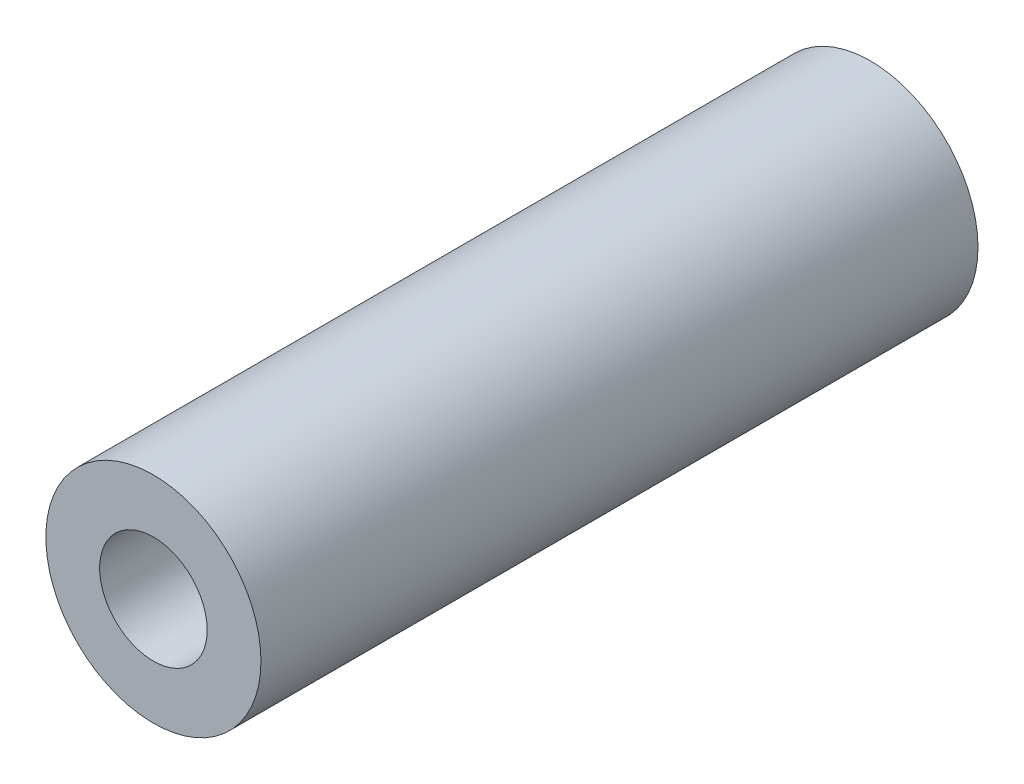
from build123d import *

# Parameters (mm, degrees)
ESQUISSE1_R        = 3
ESQUISSE1_R_2      = 1.5
BOSS_EXTRU_1_DEPTH = 20


with BuildPart() as part:
    # Esquisse1 → Boss.-Extru.1 (new body)
    with BuildSketch(Plane.XY):
        Circle(ESQUISSE1_R)
        Circle(ESQUISSE1_R_2, mode=Mode.SUBTRACT)
    extrude(amount=BOSS_EXTRU_1_DEPTH)


solid = part.part
